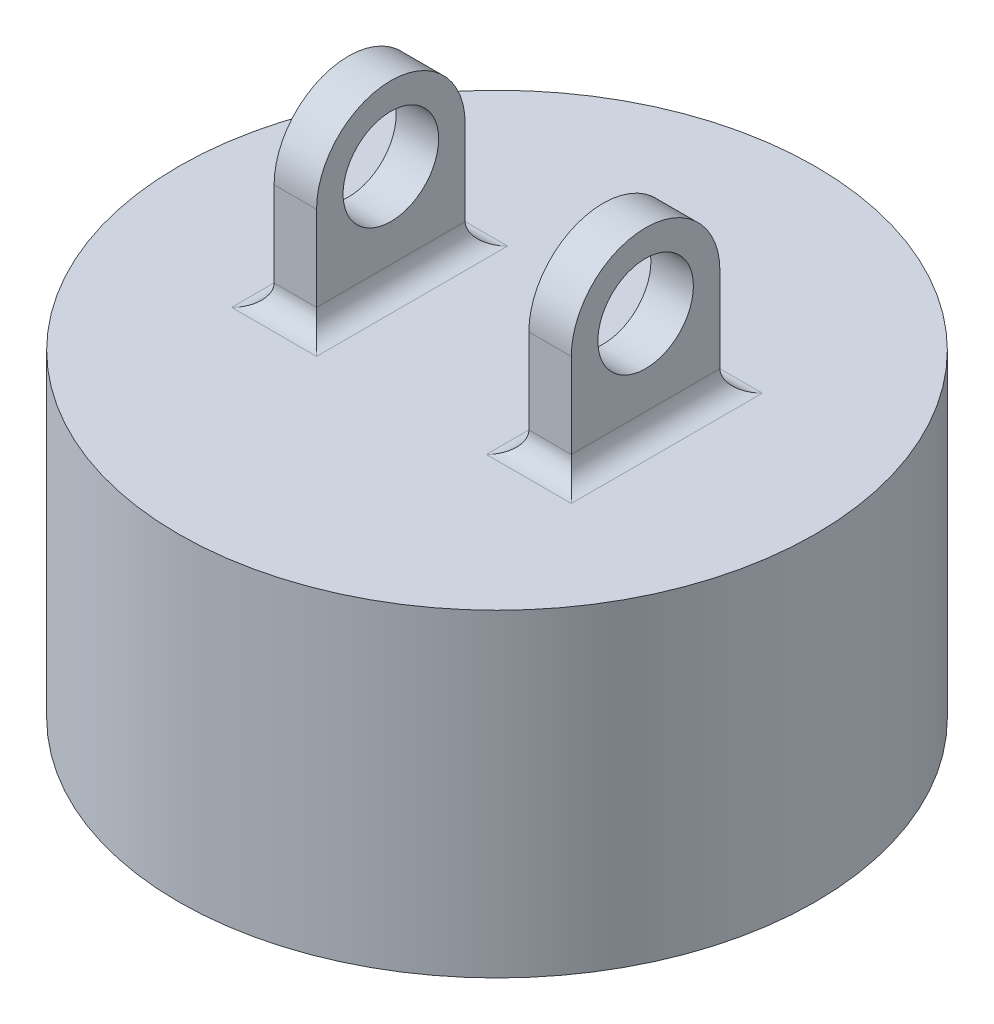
ISO-10303-21;
HEADER;
FILE_DESCRIPTION(('STEP AP214'),'2;1');
FILE_NAME('part.step','',(''),(''),'','','');
FILE_SCHEMA(('AUTOMOTIVE_DESIGN { 1 0 10303 214 1 1 1 1 }'));
ENDSEC;
DATA;
#1=APPLICATION_CONTEXT('core data for automotive mechanical design processes');
#2=APPLICATION_PROTOCOL_DEFINITION('international standard','automotive_design',2000,#1);
#3=PRODUCT_CONTEXT('',#1,'mechanical');
#4=PRODUCT('Part','Part','',(#3));
#5=PRODUCT_RELATED_PRODUCT_CATEGORY('part','',(#4));
#6=PRODUCT_DEFINITION_FORMATION('','',#4);
#7=PRODUCT_DEFINITION_CONTEXT('part definition',#1,'design');
#8=PRODUCT_DEFINITION('design','',#6,#7);
#9=PRODUCT_DEFINITION_SHAPE('','',#8);
#10=(LENGTH_UNIT() NAMED_UNIT(*) SI_UNIT(.MILLI.,.METRE.));
#11=(NAMED_UNIT(*) PLANE_ANGLE_UNIT() SI_UNIT($,.RADIAN.));
#12=(NAMED_UNIT(*) SI_UNIT($,.STERADIAN.) SOLID_ANGLE_UNIT());
#13=UNCERTAINTY_MEASURE_WITH_UNIT(LENGTH_MEASURE(1.E-05),#10,'distance_accuracy_value','');
#14=(GEOMETRIC_REPRESENTATION_CONTEXT(3) GLOBAL_UNCERTAINTY_ASSIGNED_CONTEXT((#13)) GLOBAL_UNIT_ASSIGNED_CONTEXT((#10,
#11,#12)) REPRESENTATION_CONTEXT('',''));
#15=CARTESIAN_POINT('',(0.,0.,0.));
#16=DIRECTION('',(0.,0.,1.));
#17=DIRECTION('',(1.,0.,0.));
#18=AXIS2_PLACEMENT_3D('',#15,#16,#17);
#19=CARTESIAN_POINT('',(0.,150.,0.));
#20=DIRECTION('',(0.,1.,0.));
#21=DIRECTION('',(0.,0.,1.));
#22=AXIS2_PLACEMENT_3D('',#19,#20,#21);
#23=PLANE('',#22);
#24=DIRECTION('',(0.,0.,-1.));
#25=VECTOR('',#24,1.);
#26=CARTESIAN_POINT('',(80.,150.,0.));
#27=LINE('',#26,#25);
#28=CARTESIAN_POINT('',(80.,150.,-45.));
#29=VERTEX_POINT('',#28);
#30=CARTESIAN_POINT('',(80.,150.,45.));
#31=VERTEX_POINT('',#30);
#32=EDGE_CURVE('E203',#29,#31,#27,.F.);
#33=ORIENTED_EDGE('',*,*,#32,.T.);
#34=DIRECTION('',(-1.,0.,0.));
#35=VECTOR('',#34,1.);
#36=CARTESIAN_POINT('',(0.,150.,45.));
#37=LINE('',#36,#35);
#38=CARTESIAN_POINT('',(40.,150.,45.));
#39=VERTEX_POINT('',#38);
#40=EDGE_CURVE('E207',#31,#39,#37,.T.);
#41=ORIENTED_EDGE('',*,*,#40,.T.);
#42=DIRECTION('',(0.,0.,-1.));
#43=VECTOR('',#42,1.);
#44=CARTESIAN_POINT('',(40.,150.,-35.));
#45=LINE('',#44,#43);
#46=CARTESIAN_POINT('',(40.,150.,-45.));
#47=VERTEX_POINT('',#46);
#48=EDGE_CURVE('E205',#39,#47,#45,.T.);
#49=ORIENTED_EDGE('',*,*,#48,.T.);
#50=DIRECTION('',(-1.,0.,0.));
#51=VECTOR('',#50,1.);
#52=CARTESIAN_POINT('',(0.,150.,-45.));
#53=LINE('',#52,#51);
#54=EDGE_CURVE('E201',#47,#29,#53,.F.);
#55=ORIENTED_EDGE('',*,*,#54,.T.);
#56=EDGE_LOOP('',(#33,#41,#49,#55));
#57=FACE_BOUND('',#56,.T.);
#58=DIRECTION('',(0.,0.,-1.));
#59=VECTOR('',#58,1.);
#60=CARTESIAN_POINT('',(-80.,150.,0.));
#61=LINE('',#60,#59);
#62=CARTESIAN_POINT('',(-80.,150.,45.));
#63=VERTEX_POINT('',#62);
#64=CARTESIAN_POINT('',(-80.,150.,-45.));
#65=VERTEX_POINT('',#64);
#66=EDGE_CURVE('E196',#63,#65,#61,.T.);
#67=ORIENTED_EDGE('',*,*,#66,.T.);
#68=DIRECTION('',(1.,0.,0.));
#69=VECTOR('',#68,1.);
#70=CARTESIAN_POINT('',(-50.,150.,-45.));
#71=LINE('',#70,#69);
#72=CARTESIAN_POINT('',(-40.,150.,-45.));
#73=VERTEX_POINT('',#72);
#74=EDGE_CURVE('E198',#65,#73,#71,.T.);
#75=ORIENTED_EDGE('',*,*,#74,.T.);
#76=DIRECTION('',(0.,0.,-1.));
#77=VECTOR('',#76,1.);
#78=CARTESIAN_POINT('',(-40.,150.,35.));
#79=LINE('',#78,#77);
#80=CARTESIAN_POINT('',(-40.,150.,45.));
#81=VERTEX_POINT('',#80);
#82=EDGE_CURVE('E194',#73,#81,#79,.F.);
#83=ORIENTED_EDGE('',*,*,#82,.T.);
#84=DIRECTION('',(1.,0.,0.));
#85=VECTOR('',#84,1.);
#86=CARTESIAN_POINT('',(-70.,150.,45.));
#87=LINE('',#86,#85);
#88=EDGE_CURVE('E190',#81,#63,#87,.F.);
#89=ORIENTED_EDGE('',*,*,#88,.T.);
#90=EDGE_LOOP('',(#67,#75,#83,#89));
#91=FACE_BOUND('',#90,.T.);
#92=CARTESIAN_POINT('',(0.,150.,0.));
#93=DIRECTION('',(0.,1.,0.));
#94=DIRECTION('',(0.,0.,1.));
#95=AXIS2_PLACEMENT_3D('',#92,#93,#94);
#96=CIRCLE('',#95,150.);
#97=CARTESIAN_POINT('',(0.,150.,150.));
#98=VERTEX_POINT('',#97);
#99=EDGE_CURVE('E187',#98,#98,#96,.T.);
#100=ORIENTED_EDGE('',*,*,#99,.T.);
#101=EDGE_LOOP('',(#100));
#102=FACE_BOUND('',#101,.T.);
#103=ADVANCED_FACE('F36',(#57,#91,#102),#23,.T.);
#104=CARTESIAN_POINT('',(0.,150.,0.));
#105=DIRECTION('',(0.,-1.,0.));
#106=DIRECTION('',(0.,0.,-1.));
#107=AXIS2_PLACEMENT_3D('',#104,#105,#106);
#108=CYLINDRICAL_SURFACE('',#107,150.);
#109=ORIENTED_EDGE('',*,*,#99,.F.);
#110=EDGE_LOOP('',(#109));
#111=FACE_BOUND('',#110,.T.);
#112=CARTESIAN_POINT('',(0.,0.,0.));
#113=DIRECTION('',(0.,1.,0.));
#114=DIRECTION('',(0.,0.,1.));
#115=AXIS2_PLACEMENT_3D('',#112,#113,#114);
#116=CIRCLE('',#115,150.);
#117=CARTESIAN_POINT('',(0.,0.,150.));
#118=VERTEX_POINT('',#117);
#119=EDGE_CURVE('E184',#118,#118,#116,.T.);
#120=ORIENTED_EDGE('',*,*,#119,.T.);
#121=EDGE_LOOP('',(#120));
#122=FACE_BOUND('',#121,.T.);
#123=ADVANCED_FACE('F266',(#111,#122),#108,.T.);
#124=CARTESIAN_POINT('',(0.,0.,0.));
#125=DIRECTION('',(0.,1.,0.));
#126=DIRECTION('',(0.,0.,1.));
#127=AXIS2_PLACEMENT_3D('',#124,#125,#126);
#128=PLANE('',#127);
#129=CARTESIAN_POINT('',(0.,0.,0.));
#130=DIRECTION('',(0.,-1.,0.));
#131=DIRECTION('',(0.,0.,-1.));
#132=AXIS2_PLACEMENT_3D('',#129,#130,#131);
#133=CIRCLE('',#132,75.);
#134=CARTESIAN_POINT('',(0.,0.,-75.));
#135=VERTEX_POINT('',#134);
#136=EDGE_CURVE('E180',#135,#135,#133,.T.);
#137=ORIENTED_EDGE('',*,*,#136,.F.);
#138=EDGE_LOOP('',(#137));
#139=FACE_BOUND('',#138,.T.);
#140=ORIENTED_EDGE('',*,*,#119,.F.);
#141=EDGE_LOOP('',(#140));
#142=FACE_BOUND('',#141,.T.);
#143=ADVANCED_FACE('F273',(#139,#142),#128,.F.);
#144=CARTESIAN_POINT('',(0.,100.,0.));
#145=DIRECTION('',(0.,-1.,0.));
#146=DIRECTION('',(0.,0.,-1.));
#147=AXIS2_PLACEMENT_3D('',#144,#145,#146);
#148=CYLINDRICAL_SURFACE('',#147,75.);
#149=CARTESIAN_POINT('',(0.,100.,0.));
#150=DIRECTION('',(0.,-1.,0.));
#151=DIRECTION('',(0.,0.,-1.));
#152=AXIS2_PLACEMENT_3D('',#149,#150,#151);
#153=CIRCLE('',#152,75.);
#154=CARTESIAN_POINT('',(0.,100.,-75.));
#155=VERTEX_POINT('',#154);
#156=EDGE_CURVE('E181',#155,#155,#153,.T.);
#157=ORIENTED_EDGE('',*,*,#156,.F.);
#158=EDGE_LOOP('',(#157));
#159=FACE_BOUND('',#158,.T.);
#160=ORIENTED_EDGE('',*,*,#136,.T.);
#161=EDGE_LOOP('',(#160));
#162=FACE_BOUND('',#161,.T.);
#163=ADVANCED_FACE('F278',(#159,#162),#148,.F.);
#164=CARTESIAN_POINT('',(0.,100.,0.));
#165=DIRECTION('',(0.,-1.,0.));
#166=DIRECTION('',(0.,0.,-1.));
#167=AXIS2_PLACEMENT_3D('',#164,#165,#166);
#168=PLANE('',#167);
#169=ORIENTED_EDGE('',*,*,#156,.T.);
#170=EDGE_LOOP('',(#169));
#171=FACE_BOUND('',#170,.T.);
#172=ADVANCED_FACE('F284',(#171),#168,.T.);
#173=CARTESIAN_POINT('',(70.,200.,0.));
#174=DIRECTION('',(-1.,0.,0.));
#175=DIRECTION('',(0.,0.,1.));
#176=AXIS2_PLACEMENT_3D('',#173,#174,#175);
#177=PLANE('',#176);
#178=DIRECTION('',(0.,-1.,0.));
#179=VECTOR('',#178,1.);
#180=CARTESIAN_POINT('',(70.,150.,35.));
#181=LINE('',#180,#179);
#182=CARTESIAN_POINT('',(70.,200.,35.));
#183=VERTEX_POINT('',#182);
#184=CARTESIAN_POINT('',(70.,160.,35.));
#185=VERTEX_POINT('',#184);
#186=EDGE_CURVE('E166',#183,#185,#181,.T.);
#187=ORIENTED_EDGE('',*,*,#186,.T.);
#188=DIRECTION('',(0.,0.,-1.));
#189=VECTOR('',#188,1.);
#190=CARTESIAN_POINT('',(70.,160.,0.));
#191=LINE('',#190,#189);
#192=CARTESIAN_POINT('',(70.,160.,-35.));
#193=VERTEX_POINT('',#192);
#194=EDGE_CURVE('E215',#185,#193,#191,.T.);
#195=ORIENTED_EDGE('',*,*,#194,.T.);
#196=DIRECTION('',(0.,1.,0.));
#197=VECTOR('',#196,1.);
#198=CARTESIAN_POINT('',(70.,200.,-35.));
#199=LINE('',#198,#197);
#200=CARTESIAN_POINT('',(70.,200.,-35.));
#201=VERTEX_POINT('',#200);
#202=EDGE_CURVE('E161',#193,#201,#199,.T.);
#203=ORIENTED_EDGE('',*,*,#202,.T.);
#204=CARTESIAN_POINT('',(70.,200.,0.));
#205=DIRECTION('',(1.,0.,0.));
#206=DIRECTION('',(0.,0.,1.));
#207=AXIS2_PLACEMENT_3D('',#204,#205,#206);
#208=CIRCLE('',#207,35.);
#209=EDGE_CURVE('E163',#201,#183,#208,.T.);
#210=ORIENTED_EDGE('',*,*,#209,.T.);
#211=EDGE_LOOP('',(#187,#195,#203,#210));
#212=FACE_BOUND('',#211,.T.);
#213=CARTESIAN_POINT('',(70.,200.,0.));
#214=DIRECTION('',(1.,0.,0.));
#215=DIRECTION('',(0.,0.,-1.));
#216=AXIS2_PLACEMENT_3D('',#213,#214,#215);
#217=CIRCLE('',#216,22.5);
#218=CARTESIAN_POINT('',(70.,200.,-22.5));
#219=VERTEX_POINT('',#218);
#220=EDGE_CURVE('E155',#219,#219,#217,.T.);
#221=ORIENTED_EDGE('',*,*,#220,.F.);
#222=EDGE_LOOP('',(#221));
#223=FACE_BOUND('',#222,.T.);
#224=ADVANCED_FACE('F411',(#212,#223),#177,.F.);
#225=CARTESIAN_POINT('',(50.,200.,0.));
#226=DIRECTION('',(-1.,0.,0.));
#227=DIRECTION('',(0.,0.,1.));
#228=AXIS2_PLACEMENT_3D('',#225,#226,#227);
#229=PLANE('',#228);
#230=DIRECTION('',(0.,1.,0.));
#231=VECTOR('',#230,1.);
#232=CARTESIAN_POINT('',(50.,200.,-35.));
#233=LINE('',#232,#231);
#234=CARTESIAN_POINT('',(50.,160.,-35.));
#235=VERTEX_POINT('',#234);
#236=CARTESIAN_POINT('',(50.,200.,-35.));
#237=VERTEX_POINT('',#236);
#238=EDGE_CURVE('E158',#235,#237,#233,.T.);
#239=ORIENTED_EDGE('',*,*,#238,.F.);
#240=DIRECTION('',(0.,0.,-1.));
#241=VECTOR('',#240,1.);
#242=CARTESIAN_POINT('',(50.,160.,35.));
#243=LINE('',#242,#241);
#244=CARTESIAN_POINT('',(50.,160.,35.));
#245=VERTEX_POINT('',#244);
#246=EDGE_CURVE('E213',#235,#245,#243,.F.);
#247=ORIENTED_EDGE('',*,*,#246,.T.);
#248=DIRECTION('',(0.,-1.,0.));
#249=VECTOR('',#248,1.);
#250=CARTESIAN_POINT('',(50.,150.,35.));
#251=LINE('',#250,#249);
#252=CARTESIAN_POINT('',(50.,200.,35.));
#253=VERTEX_POINT('',#252);
#254=EDGE_CURVE('E164',#253,#245,#251,.T.);
#255=ORIENTED_EDGE('',*,*,#254,.F.);
#256=CARTESIAN_POINT('',(50.,200.,0.));
#257=DIRECTION('',(1.,0.,0.));
#258=DIRECTION('',(0.,0.,1.));
#259=AXIS2_PLACEMENT_3D('',#256,#257,#258);
#260=CIRCLE('',#259,35.);
#261=EDGE_CURVE('E171',#237,#253,#260,.T.);
#262=ORIENTED_EDGE('',*,*,#261,.F.);
#263=EDGE_LOOP('',(#239,#247,#255,#262));
#264=FACE_BOUND('',#263,.T.);
#265=CARTESIAN_POINT('',(50.,200.,0.));
#266=DIRECTION('',(1.,0.,0.));
#267=DIRECTION('',(0.,0.,-1.));
#268=AXIS2_PLACEMENT_3D('',#265,#266,#267);
#269=CIRCLE('',#268,22.5);
#270=CARTESIAN_POINT('',(50.,200.,-22.5));
#271=VERTEX_POINT('',#270);
#272=EDGE_CURVE('E133',#271,#271,#269,.T.);
#273=ORIENTED_EDGE('',*,*,#272,.T.);
#274=EDGE_LOOP('',(#273));
#275=FACE_BOUND('',#274,.T.);
#276=ADVANCED_FACE('F403',(#264,#275),#229,.T.);
#277=CARTESIAN_POINT('',(70.,200.,-35.));
#278=DIRECTION('',(0.,0.,1.));
#279=DIRECTION('',(1.,0.,0.));
#280=AXIS2_PLACEMENT_3D('',#277,#278,#279);
#281=PLANE('',#280);
#282=ORIENTED_EDGE('',*,*,#202,.F.);
#283=DIRECTION('',(-1.,0.,0.));
#284=VECTOR('',#283,1.);
#285=CARTESIAN_POINT('',(70.,160.,-35.));
#286=LINE('',#285,#284);
#287=EDGE_CURVE('E217',#193,#235,#286,.T.);
#288=ORIENTED_EDGE('',*,*,#287,.T.);
#289=ORIENTED_EDGE('',*,*,#238,.T.);
#290=DIRECTION('',(-1.,0.,0.));
#291=VECTOR('',#290,1.);
#292=CARTESIAN_POINT('',(70.,200.,-35.));
#293=LINE('',#292,#291);
#294=EDGE_CURVE('E177',#201,#237,#293,.T.);
#295=ORIENTED_EDGE('',*,*,#294,.F.);
#296=EDGE_LOOP('',(#282,#288,#289,#295));
#297=FACE_BOUND('',#296,.T.);
#298=ADVANCED_FACE('F395',(#297),#281,.F.);
#299=CARTESIAN_POINT('',(70.,200.,0.));
#300=DIRECTION('',(-1.,0.,0.));
#301=DIRECTION('',(0.,0.,1.));
#302=AXIS2_PLACEMENT_3D('',#299,#300,#301);
#303=CYLINDRICAL_SURFACE('',#302,35.);
#304=ORIENTED_EDGE('',*,*,#261,.T.);
#305=DIRECTION('',(-1.,0.,0.));
#306=VECTOR('',#305,1.);
#307=CARTESIAN_POINT('',(70.,200.,35.));
#308=LINE('',#307,#306);
#309=EDGE_CURVE('E169',#183,#253,#308,.T.);
#310=ORIENTED_EDGE('',*,*,#309,.F.);
#311=ORIENTED_EDGE('',*,*,#209,.F.);
#312=ORIENTED_EDGE('',*,*,#294,.T.);
#313=EDGE_LOOP('',(#304,#310,#311,#312));
#314=FACE_BOUND('',#313,.T.);
#315=ADVANCED_FACE('F387',(#314),#303,.T.);
#316=CARTESIAN_POINT('',(70.,150.,35.));
#317=DIRECTION('',(0.,0.,-1.));
#318=DIRECTION('',(-1.,0.,0.));
#319=AXIS2_PLACEMENT_3D('',#316,#317,#318);
#320=PLANE('',#319);
#321=ORIENTED_EDGE('',*,*,#254,.T.);
#322=DIRECTION('',(-1.,0.,0.));
#323=VECTOR('',#322,1.);
#324=CARTESIAN_POINT('',(70.,160.,35.));
#325=LINE('',#324,#323);
#326=EDGE_CURVE('E210',#245,#185,#325,.F.);
#327=ORIENTED_EDGE('',*,*,#326,.T.);
#328=ORIENTED_EDGE('',*,*,#186,.F.);
#329=ORIENTED_EDGE('',*,*,#309,.T.);
#330=EDGE_LOOP('',(#321,#327,#328,#329));
#331=FACE_BOUND('',#330,.T.);
#332=ADVANCED_FACE('F379',(#331),#320,.F.);
#333=CARTESIAN_POINT('',(70.,200.,0.));
#334=DIRECTION('',(-1.,0.,0.));
#335=DIRECTION('',(0.,0.,1.));
#336=AXIS2_PLACEMENT_3D('',#333,#334,#335);
#337=CYLINDRICAL_SURFACE('',#336,22.5);
#338=ORIENTED_EDGE('',*,*,#220,.T.);
#339=EDGE_LOOP('',(#338));
#340=FACE_BOUND('',#339,.T.);
#341=ORIENTED_EDGE('',*,*,#272,.F.);
#342=EDGE_LOOP('',(#341));
#343=FACE_BOUND('',#342,.T.);
#344=ADVANCED_FACE('F372',(#340,#343),#337,.F.);
#345=CARTESIAN_POINT('',(-70.,150.,35.));
#346=DIRECTION('',(0.,0.,1.));
#347=DIRECTION('',(1.,0.,0.));
#348=AXIS2_PLACEMENT_3D('',#345,#346,#347);
#349=PLANE('',#348);
#350=DIRECTION('',(0.,-1.,0.));
#351=VECTOR('',#350,1.);
#352=CARTESIAN_POINT('',(-70.,150.,35.));
#353=LINE('',#352,#351);
#354=CARTESIAN_POINT('',(-70.,200.,35.));
#355=VERTEX_POINT('',#354);
#356=CARTESIAN_POINT('',(-70.,160.,35.));
#357=VERTEX_POINT('',#356);
#358=EDGE_CURVE('E127',#355,#357,#353,.T.);
#359=ORIENTED_EDGE('',*,*,#358,.T.);
#360=DIRECTION('',(1.,0.,0.));
#361=VECTOR('',#360,1.);
#362=CARTESIAN_POINT('',(-50.,160.,35.));
#363=LINE('',#362,#361);
#364=CARTESIAN_POINT('',(-50.,160.,35.));
#365=VERTEX_POINT('',#364);
#366=EDGE_CURVE('E11',#357,#365,#363,.T.);
#367=ORIENTED_EDGE('',*,*,#366,.T.);
#368=DIRECTION('',(0.,-1.,0.));
#369=VECTOR('',#368,1.);
#370=CARTESIAN_POINT('',(-50.,150.,35.));
#371=LINE('',#370,#369);
#372=CARTESIAN_POINT('',(-50.,200.,35.));
#373=VERTEX_POINT('',#372);
#374=EDGE_CURVE('E128',#373,#365,#371,.T.);
#375=ORIENTED_EDGE('',*,*,#374,.F.);
#376=DIRECTION('',(1.,0.,0.));
#377=VECTOR('',#376,1.);
#378=CARTESIAN_POINT('',(-70.,200.,35.));
#379=LINE('',#378,#377);
#380=EDGE_CURVE('E125',#355,#373,#379,.T.);
#381=ORIENTED_EDGE('',*,*,#380,.F.);
#382=EDGE_LOOP('',(#359,#367,#375,#381));
#383=FACE_BOUND('',#382,.T.);
#384=ADVANCED_FACE('F126',(#383),#349,.T.);
#385=CARTESIAN_POINT('',(-70.,200.,0.));
#386=DIRECTION('',(1.,0.,0.));
#387=DIRECTION('',(0.,0.,-1.));
#388=AXIS2_PLACEMENT_3D('',#385,#386,#387);
#389=CYLINDRICAL_SURFACE('',#388,35.);
#390=CARTESIAN_POINT('',(-50.,200.,0.));
#391=DIRECTION('',(1.,0.,0.));
#392=DIRECTION('',(0.,0.,1.));
#393=AXIS2_PLACEMENT_3D('',#390,#391,#392);
#394=CIRCLE('',#393,35.);
#395=CARTESIAN_POINT('',(-50.,200.,-35.));
#396=VERTEX_POINT('',#395);
#397=EDGE_CURVE('E150',#396,#373,#394,.T.);
#398=ORIENTED_EDGE('',*,*,#397,.F.);
#399=DIRECTION('',(1.,0.,0.));
#400=VECTOR('',#399,1.);
#401=CARTESIAN_POINT('',(-70.,200.,-35.));
#402=LINE('',#401,#400);
#403=CARTESIAN_POINT('',(-70.,200.,-35.));
#404=VERTEX_POINT('',#403);
#405=EDGE_CURVE('E134',#404,#396,#402,.T.);
#406=ORIENTED_EDGE('',*,*,#405,.F.);
#407=CARTESIAN_POINT('',(-70.,200.,0.));
#408=DIRECTION('',(1.,0.,0.));
#409=DIRECTION('',(0.,0.,1.));
#410=AXIS2_PLACEMENT_3D('',#407,#408,#409);
#411=CIRCLE('',#410,35.);
#412=EDGE_CURVE('E138',#404,#355,#411,.T.);
#413=ORIENTED_EDGE('',*,*,#412,.T.);
#414=ORIENTED_EDGE('',*,*,#380,.T.);
#415=EDGE_LOOP('',(#398,#406,#413,#414));
#416=FACE_BOUND('',#415,.T.);
#417=ADVANCED_FACE('F142',(#416),#389,.T.);
#418=CARTESIAN_POINT('',(-70.,200.,-35.));
#419=DIRECTION('',(0.,0.,-1.));
#420=DIRECTION('',(-1.,0.,0.));
#421=AXIS2_PLACEMENT_3D('',#418,#419,#420);
#422=PLANE('',#421);
#423=DIRECTION('',(0.,1.,0.));
#424=VECTOR('',#423,1.);
#425=CARTESIAN_POINT('',(-50.,200.,-35.));
#426=LINE('',#425,#424);
#427=CARTESIAN_POINT('',(-50.,160.,-35.));
#428=VERTEX_POINT('',#427);
#429=EDGE_CURVE('E139',#428,#396,#426,.T.);
#430=ORIENTED_EDGE('',*,*,#429,.F.);
#431=DIRECTION('',(1.,0.,0.));
#432=VECTOR('',#431,1.);
#433=CARTESIAN_POINT('',(-70.,160.,-35.));
#434=LINE('',#433,#432);
#435=CARTESIAN_POINT('',(-70.,160.,-35.));
#436=VERTEX_POINT('',#435);
#437=EDGE_CURVE('E219',#428,#436,#434,.F.);
#438=ORIENTED_EDGE('',*,*,#437,.T.);
#439=DIRECTION('',(0.,1.,0.));
#440=VECTOR('',#439,1.);
#441=CARTESIAN_POINT('',(-70.,200.,-35.));
#442=LINE('',#441,#440);
#443=EDGE_CURVE('E144',#436,#404,#442,.T.);
#444=ORIENTED_EDGE('',*,*,#443,.T.);
#445=ORIENTED_EDGE('',*,*,#405,.T.);
#446=EDGE_LOOP('',(#430,#438,#444,#445));
#447=FACE_BOUND('',#446,.T.);
#448=ADVANCED_FACE('F259',(#447),#422,.T.);
#449=CARTESIAN_POINT('',(-70.,200.,0.));
#450=DIRECTION('',(1.,0.,0.));
#451=DIRECTION('',(0.,0.,1.));
#452=AXIS2_PLACEMENT_3D('',#449,#450,#451);
#453=PLANE('',#452);
#454=CARTESIAN_POINT('',(-70.,200.,0.));
#455=DIRECTION('',(1.,0.,0.));
#456=DIRECTION('',(0.,0.,-1.));
#457=AXIS2_PLACEMENT_3D('',#454,#455,#456);
#458=CIRCLE('',#457,22.5);
#459=CARTESIAN_POINT('',(-70.,200.,-22.5));
#460=VERTEX_POINT('',#459);
#461=EDGE_CURVE('E151',#460,#460,#458,.T.);
#462=ORIENTED_EDGE('',*,*,#461,.T.);
#463=EDGE_LOOP('',(#462));
#464=FACE_BOUND('',#463,.T.);
#465=ORIENTED_EDGE('',*,*,#443,.F.);
#466=DIRECTION('',(0.,0.,-1.));
#467=VECTOR('',#466,1.);
#468=CARTESIAN_POINT('',(-70.,160.,0.));
#469=LINE('',#468,#467);
#470=EDGE_CURVE('E59',#436,#357,#469,.F.);
#471=ORIENTED_EDGE('',*,*,#470,.T.);
#472=ORIENTED_EDGE('',*,*,#358,.F.);
#473=ORIENTED_EDGE('',*,*,#412,.F.);
#474=EDGE_LOOP('',(#465,#471,#472,#473));
#475=FACE_BOUND('',#474,.T.);
#476=ADVANCED_FACE('F137',(#464,#475),#453,.F.);
#477=CARTESIAN_POINT('',(-50.,200.,0.));
#478=DIRECTION('',(1.,0.,0.));
#479=DIRECTION('',(0.,0.,1.));
#480=AXIS2_PLACEMENT_3D('',#477,#478,#479);
#481=PLANE('',#480);
#482=CARTESIAN_POINT('',(-50.,200.,0.));
#483=DIRECTION('',(1.,0.,0.));
#484=DIRECTION('',(0.,0.,-1.));
#485=AXIS2_PLACEMENT_3D('',#482,#483,#484);
#486=CIRCLE('',#485,22.5);
#487=CARTESIAN_POINT('',(-50.,200.,-22.5));
#488=VERTEX_POINT('',#487);
#489=EDGE_CURVE('E234',#488,#488,#486,.T.);
#490=ORIENTED_EDGE('',*,*,#489,.F.);
#491=EDGE_LOOP('',(#490));
#492=FACE_BOUND('',#491,.T.);
#493=ORIENTED_EDGE('',*,*,#374,.T.);
#494=DIRECTION('',(0.,0.,-1.));
#495=VECTOR('',#494,1.);
#496=CARTESIAN_POINT('',(-50.,160.,-35.));
#497=LINE('',#496,#495);
#498=EDGE_CURVE('E45',#365,#428,#497,.T.);
#499=ORIENTED_EDGE('',*,*,#498,.T.);
#500=ORIENTED_EDGE('',*,*,#429,.T.);
#501=ORIENTED_EDGE('',*,*,#397,.T.);
#502=EDGE_LOOP('',(#493,#499,#500,#501));
#503=FACE_BOUND('',#502,.T.);
#504=ADVANCED_FACE('F256',(#492,#503),#481,.T.);
#505=CARTESIAN_POINT('',(-70.,200.,0.));
#506=DIRECTION('',(1.,0.,0.));
#507=DIRECTION('',(0.,0.,-1.));
#508=AXIS2_PLACEMENT_3D('',#505,#506,#507);
#509=CYLINDRICAL_SURFACE('',#508,22.5);
#510=ORIENTED_EDGE('',*,*,#461,.F.);
#511=EDGE_LOOP('',(#510));
#512=FACE_BOUND('',#511,.T.);
#513=ORIENTED_EDGE('',*,*,#489,.T.);
#514=EDGE_LOOP('',(#513));
#515=FACE_BOUND('',#514,.T.);
#516=ADVANCED_FACE('F304',(#512,#515),#509,.F.);
#517=CARTESIAN_POINT('',(70.,160.,-45.));
#518=DIRECTION('',(-1.,0.,0.));
#519=DIRECTION('',(0.,0.,1.));
#520=AXIS2_PLACEMENT_3D('',#517,#518,#519);
#521=CYLINDRICAL_SURFACE('',#520,10.);
#522=CARTESIAN_POINT('',(40.,160.,-45.));
#523=DIRECTION('',(-0.707106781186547,0.,0.707106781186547));
#524=DIRECTION('',(-0.707106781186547,0.,-0.707106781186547));
#525=AXIS2_PLACEMENT_3D('',#522,#523,#524);
#526=ELLIPSE('',#525,14.1421356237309,10.);
#527=EDGE_CURVE('E228',#235,#47,#526,.F.);
#528=ORIENTED_EDGE('',*,*,#527,.F.);
#529=ORIENTED_EDGE('',*,*,#287,.F.);
#530=CARTESIAN_POINT('',(80.,160.,-45.));
#531=DIRECTION('',(-0.707106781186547,0.,-0.707106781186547));
#532=DIRECTION('',(-0.707106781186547,0.,0.707106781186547));
#533=AXIS2_PLACEMENT_3D('',#530,#531,#532);
#534=ELLIPSE('',#533,14.1421356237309,10.);
#535=EDGE_CURVE('E231',#29,#193,#534,.T.);
#536=ORIENTED_EDGE('',*,*,#535,.F.);
#537=ORIENTED_EDGE('',*,*,#54,.F.);
#538=EDGE_LOOP('',(#528,#529,#536,#537));
#539=FACE_BOUND('',#538,.T.);
#540=ADVANCED_FACE('F300',(#539),#521,.F.);
#541=CARTESIAN_POINT('',(80.,160.,0.));
#542=DIRECTION('',(0.,0.,-1.));
#543=DIRECTION('',(-1.,0.,0.));
#544=AXIS2_PLACEMENT_3D('',#541,#542,#543);
#545=CYLINDRICAL_SURFACE('',#544,10.);
#546=ORIENTED_EDGE('',*,*,#535,.T.);
#547=ORIENTED_EDGE('',*,*,#194,.F.);
#548=CARTESIAN_POINT('',(80.,160.,45.));
#549=DIRECTION('',(0.707106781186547,0.,-0.707106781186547));
#550=DIRECTION('',(-0.707106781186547,0.,-0.707106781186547));
#551=AXIS2_PLACEMENT_3D('',#548,#549,#550);
#552=ELLIPSE('',#551,14.1421356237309,10.);
#553=EDGE_CURVE('E226',#31,#185,#552,.T.);
#554=ORIENTED_EDGE('',*,*,#553,.F.);
#555=ORIENTED_EDGE('',*,*,#32,.F.);
#556=EDGE_LOOP('',(#546,#547,#554,#555));
#557=FACE_BOUND('',#556,.T.);
#558=ADVANCED_FACE('F296',(#557),#545,.F.);
#559=CARTESIAN_POINT('',(40.,160.,0.));
#560=DIRECTION('',(0.,0.,1.));
#561=DIRECTION('',(1.,0.,0.));
#562=AXIS2_PLACEMENT_3D('',#559,#560,#561);
#563=CYLINDRICAL_SURFACE('',#562,10.);
#564=ORIENTED_EDGE('',*,*,#527,.T.);
#565=ORIENTED_EDGE('',*,*,#48,.F.);
#566=CARTESIAN_POINT('',(40.,160.,45.));
#567=DIRECTION('',(0.707106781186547,0.,0.707106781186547));
#568=DIRECTION('',(-0.707106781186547,0.,0.707106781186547));
#569=AXIS2_PLACEMENT_3D('',#566,#567,#568);
#570=ELLIPSE('',#569,14.1421356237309,10.);
#571=EDGE_CURVE('E224',#245,#39,#570,.F.);
#572=ORIENTED_EDGE('',*,*,#571,.F.);
#573=ORIENTED_EDGE('',*,*,#246,.F.);
#574=EDGE_LOOP('',(#564,#565,#572,#573));
#575=FACE_BOUND('',#574,.T.);
#576=ADVANCED_FACE('F292',(#575),#563,.F.);
#577=CARTESIAN_POINT('',(0.,160.,45.));
#578=DIRECTION('',(-1.,0.,0.));
#579=DIRECTION('',(0.,0.,1.));
#580=AXIS2_PLACEMENT_3D('',#577,#578,#579);
#581=CYLINDRICAL_SURFACE('',#580,10.);
#582=ORIENTED_EDGE('',*,*,#553,.T.);
#583=ORIENTED_EDGE('',*,*,#326,.F.);
#584=ORIENTED_EDGE('',*,*,#571,.T.);
#585=ORIENTED_EDGE('',*,*,#40,.F.);
#586=EDGE_LOOP('',(#582,#583,#584,#585));
#587=FACE_BOUND('',#586,.T.);
#588=ADVANCED_FACE('F289',(#587),#581,.F.);
#589=CARTESIAN_POINT('',(-70.,160.,45.));
#590=DIRECTION('',(-1.,0.,0.));
#591=DIRECTION('',(0.,0.,1.));
#592=AXIS2_PLACEMENT_3D('',#589,#590,#591);
#593=CYLINDRICAL_SURFACE('',#592,10.);
#594=CARTESIAN_POINT('',(-40.,160.,45.));
#595=DIRECTION('',(-0.707106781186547,0.,0.707106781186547));
#596=DIRECTION('',(-0.707106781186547,0.,-0.707106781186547));
#597=AXIS2_PLACEMENT_3D('',#594,#595,#596);
#598=ELLIPSE('',#597,14.1421356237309,10.);
#599=EDGE_CURVE('E238',#365,#81,#598,.T.);
#600=ORIENTED_EDGE('',*,*,#599,.F.);
#601=ORIENTED_EDGE('',*,*,#366,.F.);
#602=CARTESIAN_POINT('',(-80.,160.,45.));
#603=DIRECTION('',(-0.707106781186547,0.,-0.707106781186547));
#604=DIRECTION('',(-0.707106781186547,0.,0.707106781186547));
#605=AXIS2_PLACEMENT_3D('',#602,#603,#604);
#606=ELLIPSE('',#605,14.1421356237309,10.);
#607=EDGE_CURVE('E40',#63,#357,#606,.F.);
#608=ORIENTED_EDGE('',*,*,#607,.F.);
#609=ORIENTED_EDGE('',*,*,#88,.F.);
#610=EDGE_LOOP('',(#600,#601,#608,#609));
#611=FACE_BOUND('',#610,.T.);
#612=ADVANCED_FACE('F38',(#611),#593,.F.);
#613=CARTESIAN_POINT('',(-80.,160.,0.));
#614=DIRECTION('',(0.,0.,-1.));
#615=DIRECTION('',(-1.,0.,0.));
#616=AXIS2_PLACEMENT_3D('',#613,#614,#615);
#617=CYLINDRICAL_SURFACE('',#616,10.);
#618=ORIENTED_EDGE('',*,*,#607,.T.);
#619=ORIENTED_EDGE('',*,*,#470,.F.);
#620=CARTESIAN_POINT('',(-80.,160.,-45.));
#621=DIRECTION('',(0.707106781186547,0.,-0.707106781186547));
#622=DIRECTION('',(-0.707106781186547,0.,-0.707106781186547));
#623=AXIS2_PLACEMENT_3D('',#620,#621,#622);
#624=ELLIPSE('',#623,14.1421356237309,10.);
#625=EDGE_CURVE('E237',#65,#436,#624,.F.);
#626=ORIENTED_EDGE('',*,*,#625,.F.);
#627=ORIENTED_EDGE('',*,*,#66,.F.);
#628=EDGE_LOOP('',(#618,#619,#626,#627));
#629=FACE_BOUND('',#628,.T.);
#630=ADVANCED_FACE('F248',(#629),#617,.F.);
#631=CARTESIAN_POINT('',(-40.,160.,0.));
#632=DIRECTION('',(0.,0.,1.));
#633=DIRECTION('',(1.,0.,0.));
#634=AXIS2_PLACEMENT_3D('',#631,#632,#633);
#635=CYLINDRICAL_SURFACE('',#634,10.);
#636=ORIENTED_EDGE('',*,*,#599,.T.);
#637=ORIENTED_EDGE('',*,*,#82,.F.);
#638=CARTESIAN_POINT('',(-40.,160.,-45.));
#639=DIRECTION('',(0.707106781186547,0.,0.707106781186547));
#640=DIRECTION('',(-0.707106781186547,0.,0.707106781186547));
#641=AXIS2_PLACEMENT_3D('',#638,#639,#640);
#642=ELLIPSE('',#641,14.1421356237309,10.);
#643=EDGE_CURVE('E235',#428,#73,#642,.T.);
#644=ORIENTED_EDGE('',*,*,#643,.F.);
#645=ORIENTED_EDGE('',*,*,#498,.F.);
#646=EDGE_LOOP('',(#636,#637,#644,#645));
#647=FACE_BOUND('',#646,.T.);
#648=ADVANCED_FACE('F253',(#647),#635,.F.);
#649=CARTESIAN_POINT('',(0.,160.,-45.));
#650=DIRECTION('',(-1.,0.,0.));
#651=DIRECTION('',(0.,0.,1.));
#652=AXIS2_PLACEMENT_3D('',#649,#650,#651);
#653=CYLINDRICAL_SURFACE('',#652,10.);
#654=ORIENTED_EDGE('',*,*,#625,.T.);
#655=ORIENTED_EDGE('',*,*,#437,.F.);
#656=ORIENTED_EDGE('',*,*,#643,.T.);
#657=ORIENTED_EDGE('',*,*,#74,.F.);
#658=EDGE_LOOP('',(#654,#655,#656,#657));
#659=FACE_BOUND('',#658,.T.);
#660=ADVANCED_FACE('F261',(#659),#653,.F.);
#661=CLOSED_SHELL('',(#103,#123,#143,#163,#172,#224,#276,#298,#315,#332,#344,#384,#417,#448,
#476,#504,#516,#540,#558,#576,#588,#612,#630,#648,#660));
#662=MANIFOLD_SOLID_BREP('B2',#661);
#663=ADVANCED_BREP_SHAPE_REPRESENTATION('',(#18,#662),#14);
#664=SHAPE_DEFINITION_REPRESENTATION(#9,#663);
ENDSEC;
END-ISO-10303-21;
